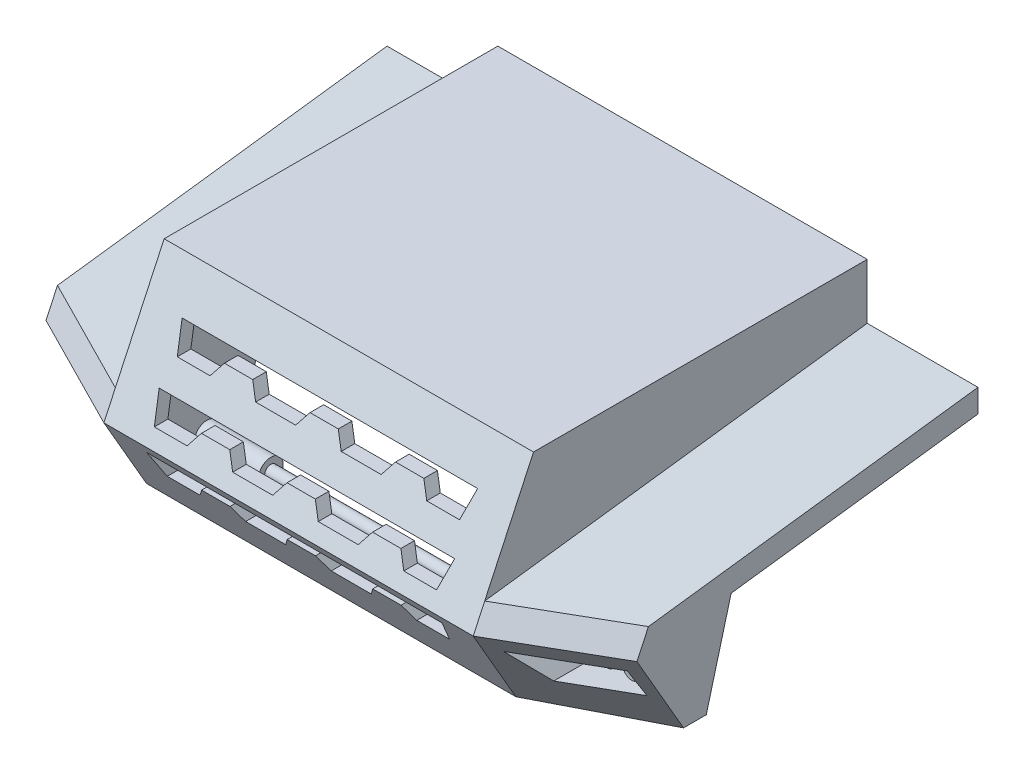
from build123d import *

# Parameters (mm, degrees)
BOSS_EXTRUDE1_DEPTH = 750
BOSS_EXTRUDE2_START = 725
BOSS_EXTRUDE2_DEPTH = 25
BOSS_EXTRUDE3_START = -725
BOSS_EXTRUDE3_DEPTH = 25
CUT_EXTRUDE1_DEPTH  = 3001.104165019
SKETCH6_R           = 50
BOSS_EXTRUDE4_DEPTH = 260
SKETCH7_R           = 25
BOSS_EXTRUDE5_DEPTH = 880
CUT_EXTRUDE2_DEPTH  = 2164.4752138
LPATTERN1_COUNT     = 3
LPATTERN1_PITCH     = 200
CUT_EXTRUDE3_START  = 1600
CUT_EXTRUDE3_DEPTH  = 400
SKETCH10_R          = 35
BOSS_EXTRUDE6_DEPTH = 100


with BuildPart() as part:
    # Sketch1 → Boss-Extrude1 (new, symmetric)
    with BuildSketch(Plane(origin=(0, 0, 0), x_dir=(0, 0, -1), z_dir=(1, 0, 0))):
        Polygon((-1323.334966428, 775), (0, 775), (0, 825), (-1355.188479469, 825), (-1600, 300), (-1426.794919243, 0), (-1369.059892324, 0), (-1543.684553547, 302.458785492), align=None)
    extrude(amount=BOSS_EXTRUDE1_DEPTH, both=True)

    # Sketch1_3 → Boss-Extrude2 (add, symmetric)
    with BuildSketch(Plane(origin=(0, 0, 0), x_dir=(0, 0, -1), z_dir=(1, 0, 0)).offset(BOSS_EXTRUDE2_START)):
        Polygon((-1369.059892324, 0), (0, 0), (0, 775), (-1323.334966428, 775), (-1543.684553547, 302.458785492), align=None)
    extrude(amount=BOSS_EXTRUDE2_DEPTH, both=True)

    # Sketch1_4 → Boss-Extrude3 (add, symmetric)
    with BuildSketch(Plane(origin=(0, 0, 0), x_dir=(0, 0, -1), z_dir=(1, 0, 0)).offset(BOSS_EXTRUDE3_START)):
        Polygon((-1369.059892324, 0), (0, 0), (0, 775), (-1323.334966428, 775), (-1543.684553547, 302.458785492), align=None)
    extrude(amount=BOSS_EXTRUDE3_DEPTH, both=True)

    # Sketch3 → Loft1 section 0
    with BuildSketch(Plane(origin=(1200, 0, 0), x_dir=(0, 0, -1), z_dir=(1, 0, 0))):
        with BuildLine():
            Line((-1195.854811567, 0), (0, 0))
            Line((0, 0), (0, 600))
            Line((0, 600), (-1338.408296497, 427.676734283))
            Line((-1338.408296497, 427.676734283), (-1385.039062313, 327.676734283))
            Line((-1385.039062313, 327.676734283), (-1195.854811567, 0))
        make_face()
    # Sketch2 → Loft1 section 1
    with BuildSketch(Plane(origin=(750, 0, 0), x_dir=(0, 0, -1), z_dir=(1, 0, 0))):
        with BuildLine():
            Line((-1426.794919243, 0), (-1600, 300))
            Line((-1600, 300), (-1553.369234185, 400))
            Line((-1553.369234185, 400), (0, 600))
            Line((0, 600), (0, 0))
            Line((0, 0), (-1426.794919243, 0))
        make_face()
    loft1 = loft()

    # Mirror1: Loft1 across plane
    add(loft1.mirror(Plane(origin=(0, 0, 0), x_dir=(0, 0, 1), z_dir=(1, 0, 0))))

    # Sketch4 → Cut-Extrude1 (cut, through all)
    with BuildSketch(Plane(origin=(1200, 0, 0), x_dir=(0, 0, -1), z_dir=(1, 0, 0))):
        Polygon((-1103.478768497, 0), (-1002.480113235, 376.932112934), (0, 506.003822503), (0, 0), align=None)
    extrude(amount=-CUT_EXTRUDE1_DEPTH, mode=Mode.SUBTRACT)

    # Sketch6 → Boss-Extrude4 (add)
    with BuildSketch(Plane(origin=(-700, 0, 0), x_dir=(0, 0, -1), z_dir=(1, 0, 0))):
        with Locations((-1231.975276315, 100)):
            Circle(SKETCH6_R)
    boss_extrude4 = extrude(amount=BOSS_EXTRUDE4_DEPTH)

    # Mirror2: Boss-Extrude4 across plane
    add(boss_extrude4.mirror(Plane(origin=(0, 0, 0), x_dir=(0, 0, 1), z_dir=(1, 0, 0))))

    # Sketch7 → Boss-Extrude5 (add)
    with BuildSketch(Plane(origin=(-440, 0, 0), x_dir=(0, 0, -1), z_dir=(1, 0, 0))):
        with Locations((-1231.975276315, 100)):
            Circle(SKETCH7_R)
    extrude(amount=BOSS_EXTRUDE5_DEPTH)

    # Sketch8 → Cut-Extrude2 (cut, through all)
    with BuildSketch(Plane.XY):
        Polygon((600, 260), (-600, 260), (-573.205080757, 160), (-440, 160), (-404.98962309, 210), (-289.98962309, 210), (-254.979246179, 160), (-92.51037691, 160), (-57.5, 210), (57.5, 210), (92.51037691, 160), (254.979246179, 160), (289.98962309, 210), (404.98962309, 210), (440, 160), (573.205080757, 160), align=None)
    cut_extrude2 = extrude(amount=CUT_EXTRUDE2_DEPTH, mode=Mode.SUBTRACT)

    # LPattern1: Cut-Extrude2 ×3
    with Locations(*[(0, i * LPATTERN1_PITCH, 0) for i in range(1, LPATTERN1_COUNT)]):
        add(cut_extrude2, mode=Mode.SUBTRACT)

    # Sketch9 → Cut-Extrude3 (cut)
    with BuildSketch(Plane.XY.offset(CUT_EXTRUDE3_START)):
        Polygon((-1150, 264.729649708), (-810, 244.781913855), (-901.065281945, 129.711639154), (-1157.04037736, 144.729649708), align=None)
    cut_extrude3 = extrude(amount=-CUT_EXTRUDE3_DEPTH, mode=Mode.SUBTRACT)

    # Mirror3: Cut-Extrude3 across plane
    add(cut_extrude3.mirror(Plane(origin=(0, 0, 0), x_dir=(0, 0, 1), z_dir=(1, 0, 0))), mode=Mode.SUBTRACT)

    # Sketch10 → Boss-Extrude6 (add)
    with BuildSketch(Plane.XY.offset(1200)):
        with Locations(Location((-1093.52018868, 201.209461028, 0), (0, 0, 180))):
            Circle(SKETCH10_R)
        with Locations(Location((-993.52018868, 195.342479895, 0), (0, 0, 180))):
            Circle(SKETCH10_R)
        with Locations((-893.52018868, 189.475498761)):
            Circle(SKETCH10_R)
    boss_extrude6 = extrude(amount=BOSS_EXTRUDE6_DEPTH)

    # Mirror5: Boss-Extrude6 across plane
    add(boss_extrude6.mirror(Plane(origin=(0, 0, 0), x_dir=(0, 0, 1), z_dir=(1, 0, 0))))


solid = part.part
